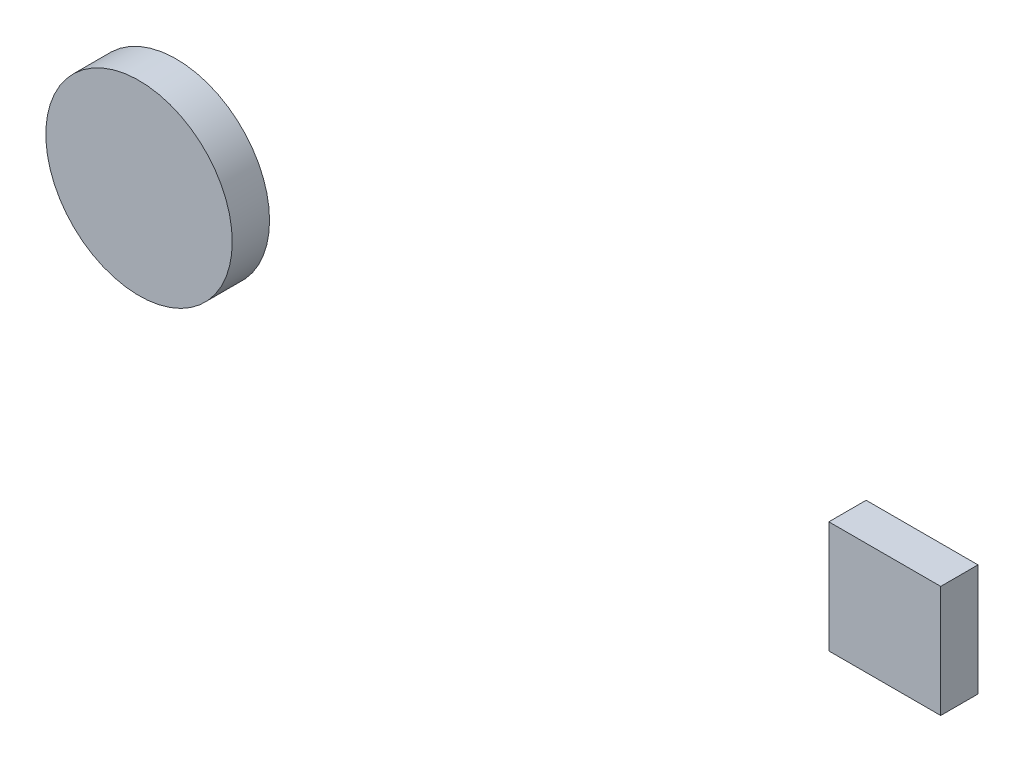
ISO-10303-21;
HEADER;
FILE_DESCRIPTION(('STEP AP214'),'2;1');
FILE_NAME('part.step','',(''),(''),'','','');
FILE_SCHEMA(('AUTOMOTIVE_DESIGN { 1 0 10303 214 1 1 1 1 }'));
ENDSEC;
DATA;
#1=APPLICATION_CONTEXT('core data for automotive mechanical design processes');
#2=APPLICATION_PROTOCOL_DEFINITION('international standard','automotive_design',2000,#1);
#3=PRODUCT_CONTEXT('',#1,'mechanical');
#4=PRODUCT('Part','Part','',(#3));
#5=PRODUCT_RELATED_PRODUCT_CATEGORY('part','',(#4));
#6=PRODUCT_DEFINITION_FORMATION('','',#4);
#7=PRODUCT_DEFINITION_CONTEXT('part definition',#1,'design');
#8=PRODUCT_DEFINITION('design','',#6,#7);
#9=PRODUCT_DEFINITION_SHAPE('','',#8);
#10=(LENGTH_UNIT() NAMED_UNIT(*) SI_UNIT(.MILLI.,.METRE.));
#11=(NAMED_UNIT(*) PLANE_ANGLE_UNIT() SI_UNIT($,.RADIAN.));
#12=(NAMED_UNIT(*) SI_UNIT($,.STERADIAN.) SOLID_ANGLE_UNIT());
#13=UNCERTAINTY_MEASURE_WITH_UNIT(LENGTH_MEASURE(1.E-05),#10,'distance_accuracy_value','');
#14=(GEOMETRIC_REPRESENTATION_CONTEXT(3) GLOBAL_UNCERTAINTY_ASSIGNED_CONTEXT((#13)) GLOBAL_UNIT_ASSIGNED_CONTEXT((#10,
#11,#12)) REPRESENTATION_CONTEXT('',''));
#15=CARTESIAN_POINT('',(0.,0.,0.));
#16=DIRECTION('',(0.,0.,1.));
#17=DIRECTION('',(1.,0.,0.));
#18=AXIS2_PLACEMENT_3D('',#15,#16,#17);
#19=CARTESIAN_POINT('',(185.,-15.,10.));
#20=DIRECTION('',(1.,0.,0.));
#21=DIRECTION('',(0.,0.,-1.));
#22=AXIS2_PLACEMENT_3D('',#19,#20,#21);
#23=PLANE('',#22);
#24=DIRECTION('',(0.,-1.,0.));
#25=VECTOR('',#24,1.);
#26=CARTESIAN_POINT('',(185.,-15.,0.));
#27=LINE('',#26,#25);
#28=CARTESIAN_POINT('',(185.,15.,0.));
#29=VERTEX_POINT('',#28);
#30=CARTESIAN_POINT('',(185.,-15.,0.));
#31=VERTEX_POINT('',#30);
#32=EDGE_CURVE('E116',#29,#31,#27,.T.);
#33=ORIENTED_EDGE('',*,*,#32,.T.);
#34=DIRECTION('',(0.,0.,-1.));
#35=VECTOR('',#34,1.);
#36=CARTESIAN_POINT('',(185.,-15.,10.));
#37=LINE('',#36,#35);
#38=CARTESIAN_POINT('',(185.,-15.,10.));
#39=VERTEX_POINT('',#38);
#40=EDGE_CURVE('E12',#39,#31,#37,.T.);
#41=ORIENTED_EDGE('',*,*,#40,.F.);
#42=DIRECTION('',(0.,-1.,0.));
#43=VECTOR('',#42,1.);
#44=CARTESIAN_POINT('',(185.,-15.,10.));
#45=LINE('',#44,#43);
#46=CARTESIAN_POINT('',(185.,15.,10.));
#47=VERTEX_POINT('',#46);
#48=EDGE_CURVE('E104',#47,#39,#45,.T.);
#49=ORIENTED_EDGE('',*,*,#48,.F.);
#50=DIRECTION('',(0.,0.,-1.));
#51=VECTOR('',#50,1.);
#52=CARTESIAN_POINT('',(185.,15.,10.));
#53=LINE('',#52,#51);
#54=EDGE_CURVE('E112',#47,#29,#53,.T.);
#55=ORIENTED_EDGE('',*,*,#54,.T.);
#56=EDGE_LOOP('',(#33,#41,#49,#55));
#57=FACE_BOUND('',#56,.T.);
#58=ADVANCED_FACE('F53',(#57),#23,.F.);
#59=CARTESIAN_POINT('',(215.,-15.,10.));
#60=DIRECTION('',(0.,1.,0.));
#61=DIRECTION('',(-1.,0.,0.));
#62=AXIS2_PLACEMENT_3D('',#59,#60,#61);
#63=PLANE('',#62);
#64=DIRECTION('',(1.,0.,0.));
#65=VECTOR('',#64,1.);
#66=CARTESIAN_POINT('',(215.,-15.,0.));
#67=LINE('',#66,#65);
#68=CARTESIAN_POINT('',(215.,-15.,0.));
#69=VERTEX_POINT('',#68);
#70=EDGE_CURVE('E108',#31,#69,#67,.T.);
#71=ORIENTED_EDGE('',*,*,#70,.T.);
#72=DIRECTION('',(0.,0.,-1.));
#73=VECTOR('',#72,1.);
#74=CARTESIAN_POINT('',(215.,-15.,10.));
#75=LINE('',#74,#73);
#76=CARTESIAN_POINT('',(215.,-15.,10.));
#77=VERTEX_POINT('',#76);
#78=EDGE_CURVE('E61',#77,#69,#75,.T.);
#79=ORIENTED_EDGE('',*,*,#78,.F.);
#80=DIRECTION('',(1.,0.,0.));
#81=VECTOR('',#80,1.);
#82=CARTESIAN_POINT('',(215.,-15.,10.));
#83=LINE('',#82,#81);
#84=EDGE_CURVE('E99',#39,#77,#83,.T.);
#85=ORIENTED_EDGE('',*,*,#84,.F.);
#86=ORIENTED_EDGE('',*,*,#40,.T.);
#87=EDGE_LOOP('',(#71,#79,#85,#86));
#88=FACE_BOUND('',#87,.T.);
#89=ADVANCED_FACE('F107',(#88),#63,.F.);
#90=CARTESIAN_POINT('',(215.,-15.,10.));
#91=DIRECTION('',(-1.,0.,0.));
#92=DIRECTION('',(0.,0.,1.));
#93=AXIS2_PLACEMENT_3D('',#90,#91,#92);
#94=PLANE('',#93);
#95=DIRECTION('',(0.,1.,0.));
#96=VECTOR('',#95,1.);
#97=CARTESIAN_POINT('',(215.,-15.,0.));
#98=LINE('',#97,#96);
#99=CARTESIAN_POINT('',(215.,15.,0.));
#100=VERTEX_POINT('',#99);
#101=EDGE_CURVE('E86',#69,#100,#98,.T.);
#102=ORIENTED_EDGE('',*,*,#101,.T.);
#103=DIRECTION('',(0.,0.,-1.));
#104=VECTOR('',#103,1.);
#105=CARTESIAN_POINT('',(215.,15.,10.));
#106=LINE('',#105,#104);
#107=CARTESIAN_POINT('',(215.,15.,10.));
#108=VERTEX_POINT('',#107);
#109=EDGE_CURVE('E109',#108,#100,#106,.T.);
#110=ORIENTED_EDGE('',*,*,#109,.F.);
#111=DIRECTION('',(0.,1.,0.));
#112=VECTOR('',#111,1.);
#113=CARTESIAN_POINT('',(215.,-15.,10.));
#114=LINE('',#113,#112);
#115=EDGE_CURVE('E102',#77,#108,#114,.T.);
#116=ORIENTED_EDGE('',*,*,#115,.F.);
#117=ORIENTED_EDGE('',*,*,#78,.T.);
#118=EDGE_LOOP('',(#102,#110,#116,#117));
#119=FACE_BOUND('',#118,.T.);
#120=ADVANCED_FACE('F110',(#119),#94,.F.);
#121=CARTESIAN_POINT('',(215.,15.,10.));
#122=DIRECTION('',(0.,-1.,0.));
#123=DIRECTION('',(1.,0.,0.));
#124=AXIS2_PLACEMENT_3D('',#121,#122,#123);
#125=PLANE('',#124);
#126=DIRECTION('',(-1.,0.,0.));
#127=VECTOR('',#126,1.);
#128=CARTESIAN_POINT('',(215.,15.,0.));
#129=LINE('',#128,#127);
#130=EDGE_CURVE('E92',#100,#29,#129,.T.);
#131=ORIENTED_EDGE('',*,*,#130,.T.);
#132=ORIENTED_EDGE('',*,*,#54,.F.);
#133=DIRECTION('',(-1.,0.,0.));
#134=VECTOR('',#133,1.);
#135=CARTESIAN_POINT('',(215.,15.,10.));
#136=LINE('',#135,#134);
#137=EDGE_CURVE('E69',#108,#47,#136,.T.);
#138=ORIENTED_EDGE('',*,*,#137,.F.);
#139=ORIENTED_EDGE('',*,*,#109,.T.);
#140=EDGE_LOOP('',(#131,#132,#138,#139));
#141=FACE_BOUND('',#140,.T.);
#142=ADVANCED_FACE('F123',(#141),#125,.F.);
#143=CARTESIAN_POINT('',(0.,0.,10.));
#144=DIRECTION('',(0.,0.,1.));
#145=DIRECTION('',(1.,0.,0.));
#146=AXIS2_PLACEMENT_3D('',#143,#144,#145);
#147=PLANE('',#146);
#148=ORIENTED_EDGE('',*,*,#48,.T.);
#149=ORIENTED_EDGE('',*,*,#84,.T.);
#150=ORIENTED_EDGE('',*,*,#115,.T.);
#151=ORIENTED_EDGE('',*,*,#137,.T.);
#152=EDGE_LOOP('',(#148,#149,#150,#151));
#153=FACE_BOUND('',#152,.T.);
#154=ADVANCED_FACE('F100',(#153),#147,.T.);
#155=CARTESIAN_POINT('',(0.,0.,0.));
#156=DIRECTION('',(0.,0.,1.));
#157=DIRECTION('',(1.,0.,0.));
#158=AXIS2_PLACEMENT_3D('',#155,#156,#157);
#159=PLANE('',#158);
#160=ORIENTED_EDGE('',*,*,#32,.F.);
#161=ORIENTED_EDGE('',*,*,#130,.F.);
#162=ORIENTED_EDGE('',*,*,#101,.F.);
#163=ORIENTED_EDGE('',*,*,#70,.F.);
#164=EDGE_LOOP('',(#160,#161,#162,#163));
#165=FACE_BOUND('',#164,.T.);
#166=ADVANCED_FACE('F126',(#165),#159,.F.);
#167=CLOSED_SHELL('',(#58,#89,#120,#142,#154,#166));
#168=MANIFOLD_SOLID_BREP('B2',#167);
#169=CARTESIAN_POINT('',(0.,0.,10.));
#170=DIRECTION('',(0.,0.,-1.));
#171=DIRECTION('',(-1.,0.,0.));
#172=AXIS2_PLACEMENT_3D('',#169,#170,#171);
#173=CYLINDRICAL_SURFACE('',#172,25.);
#174=CARTESIAN_POINT('',(0.,0.,10.));
#175=DIRECTION('',(0.,0.,1.));
#176=DIRECTION('',(1.,0.,0.));
#177=AXIS2_PLACEMENT_3D('',#174,#175,#176);
#178=CIRCLE('',#177,25.);
#179=CARTESIAN_POINT('',(25.,0.,10.));
#180=VERTEX_POINT('',#179);
#181=EDGE_CURVE('E52',#180,#180,#178,.T.);
#182=ORIENTED_EDGE('',*,*,#181,.F.);
#183=EDGE_LOOP('',(#182));
#184=FACE_BOUND('',#183,.T.);
#185=CARTESIAN_POINT('',(0.,0.,0.));
#186=DIRECTION('',(0.,0.,1.));
#187=DIRECTION('',(1.,0.,0.));
#188=AXIS2_PLACEMENT_3D('',#185,#186,#187);
#189=CIRCLE('',#188,25.);
#190=CARTESIAN_POINT('',(25.,0.,0.));
#191=VERTEX_POINT('',#190);
#192=EDGE_CURVE('E179',#191,#191,#189,.T.);
#193=ORIENTED_EDGE('',*,*,#192,.T.);
#194=EDGE_LOOP('',(#193));
#195=FACE_BOUND('',#194,.T.);
#196=ADVANCED_FACE('F176',(#184,#195),#173,.T.);
#197=CARTESIAN_POINT('',(0.,0.,10.));
#198=DIRECTION('',(0.,0.,1.));
#199=DIRECTION('',(1.,0.,0.));
#200=AXIS2_PLACEMENT_3D('',#197,#198,#199);
#201=PLANE('',#200);
#202=ORIENTED_EDGE('',*,*,#181,.T.);
#203=EDGE_LOOP('',(#202));
#204=FACE_BOUND('',#203,.T.);
#205=ADVANCED_FACE('F193',(#204),#201,.T.);
#206=CARTESIAN_POINT('',(0.,0.,0.));
#207=DIRECTION('',(0.,0.,1.));
#208=DIRECTION('',(1.,0.,0.));
#209=AXIS2_PLACEMENT_3D('',#206,#207,#208);
#210=PLANE('',#209);
#211=ORIENTED_EDGE('',*,*,#192,.F.);
#212=EDGE_LOOP('',(#211));
#213=FACE_BOUND('',#212,.T.);
#214=ADVANCED_FACE('F191',(#213),#210,.F.);
#215=CLOSED_SHELL('',(#196,#205,#214));
#216=MANIFOLD_SOLID_BREP('B6',#215);
#217=ADVANCED_BREP_SHAPE_REPRESENTATION('',(#18,#168,#216),#14);
#218=SHAPE_DEFINITION_REPRESENTATION(#9,#217);
ENDSEC;
END-ISO-10303-21;
